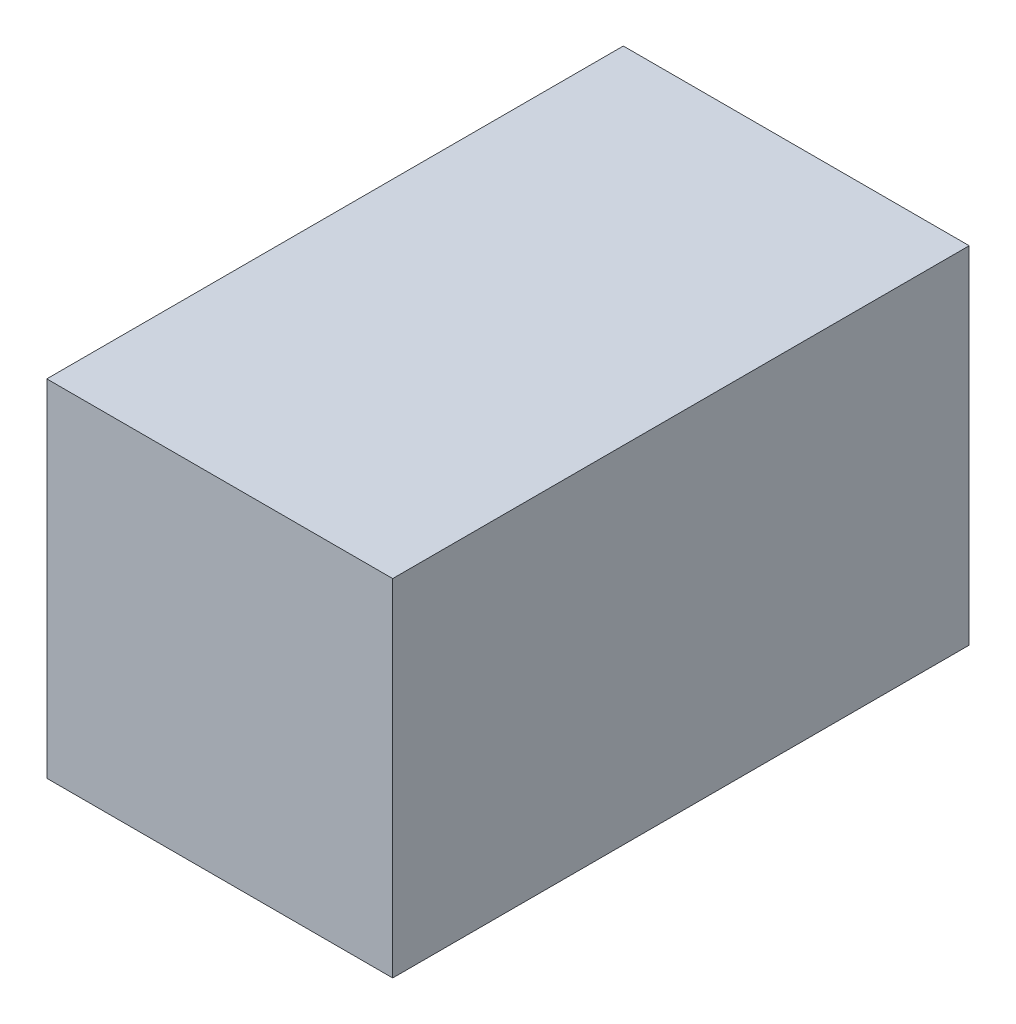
from build123d import *

# Parameters (mm, degrees)
ESQUISSE1_W      = 60
ESQUISSE1_H      = 60
EXTRUSION1_DEPTH = 100


with BuildPart() as part:
    # Esquisse1 → Extrusion1 (new body)
    with BuildSketch(Plane.XY):
        with Locations((30, 30)):
            Rectangle(ESQUISSE1_W, ESQUISSE1_H)
    extrude(amount=EXTRUSION1_DEPTH)


solid = part.part
